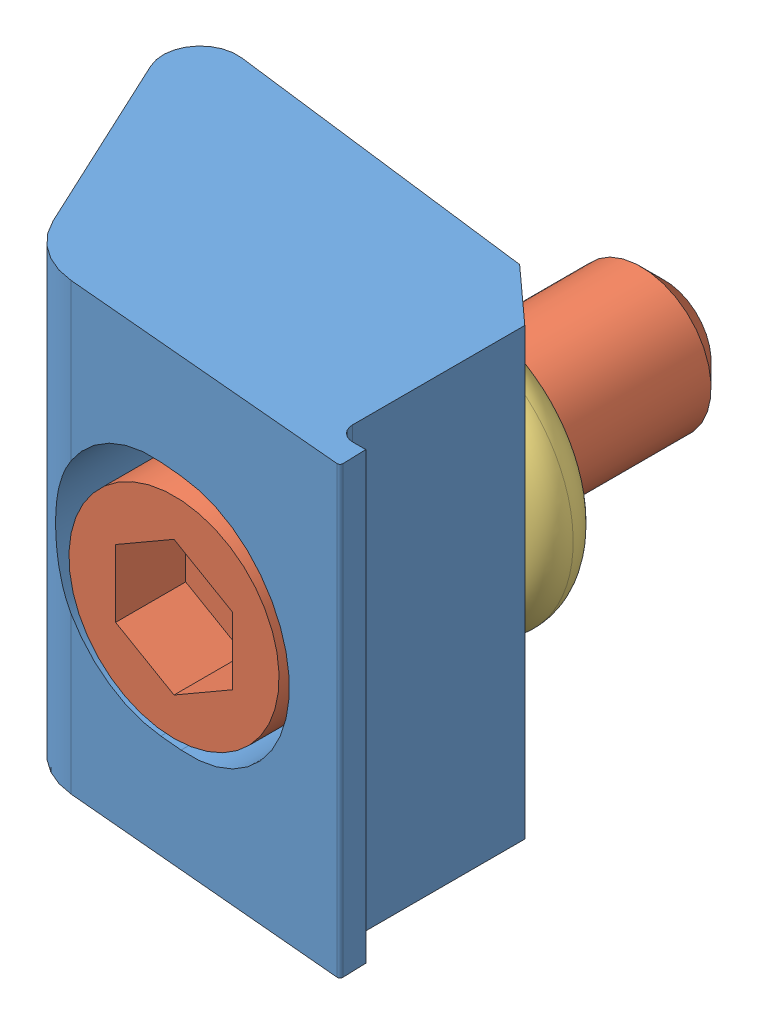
SolidWorks assembly MBSC12TC.sldasm, configuration Default (file format 15000). Lengths in mm.
Overall size (38.03 38.1 42.68).
3 component instances, 3 part files, 0 mates.
Components (placement in the parent):
- MBSC12TC_01-1: MBSC12TC_01.SLDPRT [ﾃﾞﾌｫﾙﾄ] at origin size (38.03 38.1 26.04)
- MBSC12TC_02-1: MBSC12TC_02.SLDPRT [ﾃﾞﾌｫﾙﾄ] at (0 0 13.3604) size (18 18 42)
- MBSC12TC_03-1: MBSC12TC_03.SLDPRT [ﾃﾞﾌｫﾙﾄ] at origin size (22.99 22.99 5.33)
